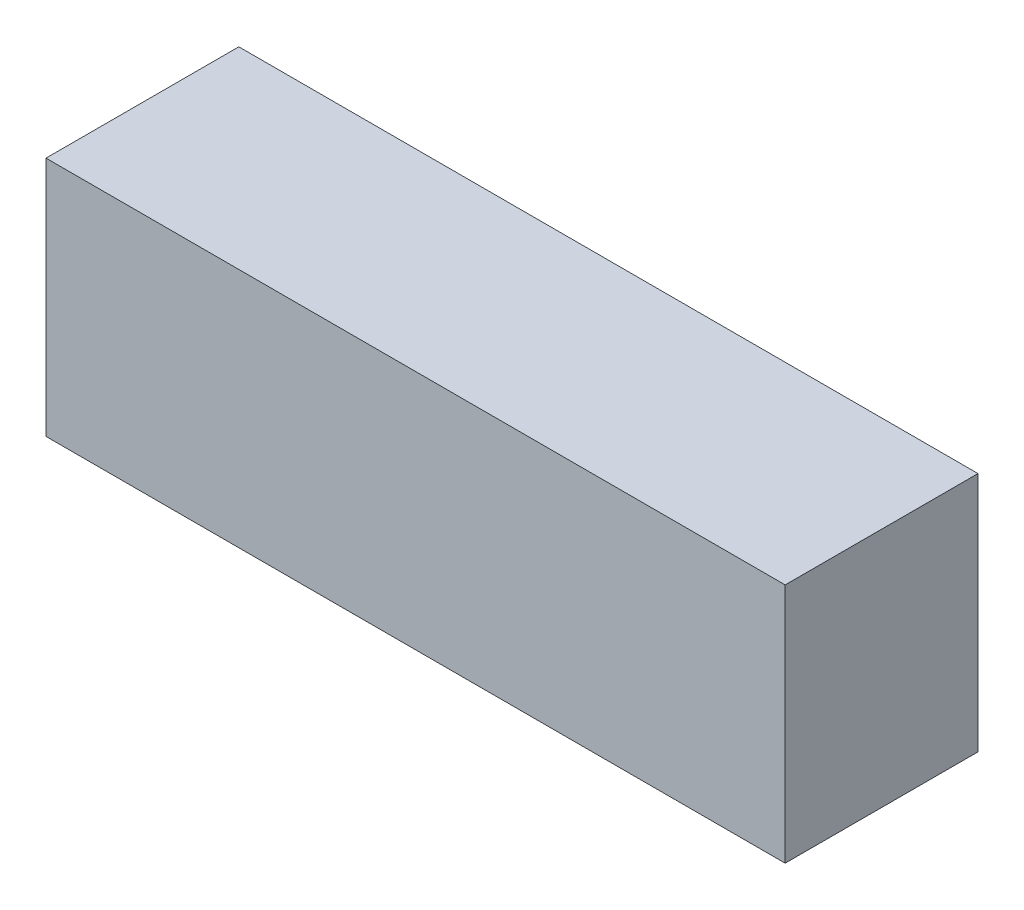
ISO-10303-21;
HEADER;
FILE_DESCRIPTION(('STEP AP214'),'2;1');
FILE_NAME('part.step','',(''),(''),'','','');
FILE_SCHEMA(('AUTOMOTIVE_DESIGN { 1 0 10303 214 1 1 1 1 }'));
ENDSEC;
DATA;
#1=APPLICATION_CONTEXT('core data for automotive mechanical design processes');
#2=APPLICATION_PROTOCOL_DEFINITION('international standard','automotive_design',2000,#1);
#3=PRODUCT_CONTEXT('',#1,'mechanical');
#4=PRODUCT('Part','Part','',(#3));
#5=PRODUCT_RELATED_PRODUCT_CATEGORY('part','',(#4));
#6=PRODUCT_DEFINITION_FORMATION('','',#4);
#7=PRODUCT_DEFINITION_CONTEXT('part definition',#1,'design');
#8=PRODUCT_DEFINITION('design','',#6,#7);
#9=PRODUCT_DEFINITION_SHAPE('','',#8);
#10=(LENGTH_UNIT() NAMED_UNIT(*) SI_UNIT(.MILLI.,.METRE.));
#11=(NAMED_UNIT(*) PLANE_ANGLE_UNIT() SI_UNIT($,.RADIAN.));
#12=(NAMED_UNIT(*) SI_UNIT($,.STERADIAN.) SOLID_ANGLE_UNIT());
#13=UNCERTAINTY_MEASURE_WITH_UNIT(LENGTH_MEASURE(1.E-05),#10,'distance_accuracy_value','');
#14=(GEOMETRIC_REPRESENTATION_CONTEXT(3) GLOBAL_UNCERTAINTY_ASSIGNED_CONTEXT((#13)) GLOBAL_UNIT_ASSIGNED_CONTEXT((#10,
#11,#12)) REPRESENTATION_CONTEXT('',''));
#15=CARTESIAN_POINT('',(0.,0.,0.));
#16=DIRECTION('',(0.,0.,1.));
#17=DIRECTION('',(1.,0.,0.));
#18=AXIS2_PLACEMENT_3D('',#15,#16,#17);
#19=CARTESIAN_POINT('',(115.,37.5,-30.));
#20=DIRECTION('',(-1.,0.,0.));
#21=DIRECTION('',(0.,0.,1.));
#22=AXIS2_PLACEMENT_3D('',#19,#20,#21);
#23=PLANE('',#22);
#24=DIRECTION('',(0.,0.,-1.));
#25=VECTOR('',#24,1.);
#26=CARTESIAN_POINT('',(115.,-37.5,-30.));
#27=LINE('',#26,#25);
#28=CARTESIAN_POINT('',(115.,-37.5,30.));
#29=VERTEX_POINT('',#28);
#30=CARTESIAN_POINT('',(115.,-37.5,-30.));
#31=VERTEX_POINT('',#30);
#32=EDGE_CURVE('E107',#29,#31,#27,.T.);
#33=ORIENTED_EDGE('',*,*,#32,.T.);
#34=DIRECTION('',(0.,-1.,0.));
#35=VECTOR('',#34,1.);
#36=CARTESIAN_POINT('',(115.,37.5,-30.));
#37=LINE('',#36,#35);
#38=CARTESIAN_POINT('',(115.,37.5,-30.));
#39=VERTEX_POINT('',#38);
#40=EDGE_CURVE('E11',#39,#31,#37,.T.);
#41=ORIENTED_EDGE('',*,*,#40,.F.);
#42=DIRECTION('',(0.,0.,-1.));
#43=VECTOR('',#42,1.);
#44=CARTESIAN_POINT('',(115.,37.5,-30.));
#45=LINE('',#44,#43);
#46=CARTESIAN_POINT('',(115.,37.5,30.));
#47=VERTEX_POINT('',#46);
#48=EDGE_CURVE('E91',#47,#39,#45,.T.);
#49=ORIENTED_EDGE('',*,*,#48,.F.);
#50=DIRECTION('',(0.,-1.,0.));
#51=VECTOR('',#50,1.);
#52=CARTESIAN_POINT('',(115.,37.5,30.));
#53=LINE('',#52,#51);
#54=EDGE_CURVE('E103',#47,#29,#53,.T.);
#55=ORIENTED_EDGE('',*,*,#54,.T.);
#56=EDGE_LOOP('',(#33,#41,#49,#55));
#57=FACE_BOUND('',#56,.T.);
#58=ADVANCED_FACE('F39',(#57),#23,.F.);
#59=CARTESIAN_POINT('',(-115.,37.5,-30.));
#60=DIRECTION('',(0.,0.,1.));
#61=DIRECTION('',(1.,0.,0.));
#62=AXIS2_PLACEMENT_3D('',#59,#60,#61);
#63=PLANE('',#62);
#64=DIRECTION('',(-1.,0.,0.));
#65=VECTOR('',#64,1.);
#66=CARTESIAN_POINT('',(-115.,-37.5,-30.));
#67=LINE('',#66,#65);
#68=CARTESIAN_POINT('',(-115.,-37.5,-30.));
#69=VERTEX_POINT('',#68);
#70=EDGE_CURVE('E96',#31,#69,#67,.T.);
#71=ORIENTED_EDGE('',*,*,#70,.T.);
#72=DIRECTION('',(0.,-1.,0.));
#73=VECTOR('',#72,1.);
#74=CARTESIAN_POINT('',(-115.,37.5,-30.));
#75=LINE('',#74,#73);
#76=CARTESIAN_POINT('',(-115.,37.5,-30.));
#77=VERTEX_POINT('',#76);
#78=EDGE_CURVE('E48',#77,#69,#75,.T.);
#79=ORIENTED_EDGE('',*,*,#78,.F.);
#80=DIRECTION('',(-1.,0.,0.));
#81=VECTOR('',#80,1.);
#82=CARTESIAN_POINT('',(-115.,37.5,-30.));
#83=LINE('',#82,#81);
#84=EDGE_CURVE('E86',#39,#77,#83,.T.);
#85=ORIENTED_EDGE('',*,*,#84,.F.);
#86=ORIENTED_EDGE('',*,*,#40,.T.);
#87=EDGE_LOOP('',(#71,#79,#85,#86));
#88=FACE_BOUND('',#87,.T.);
#89=ADVANCED_FACE('F95',(#88),#63,.F.);
#90=CARTESIAN_POINT('',(-115.,37.5,-30.));
#91=DIRECTION('',(1.,0.,0.));
#92=DIRECTION('',(0.,0.,-1.));
#93=AXIS2_PLACEMENT_3D('',#90,#91,#92);
#94=PLANE('',#93);
#95=DIRECTION('',(0.,0.,1.));
#96=VECTOR('',#95,1.);
#97=CARTESIAN_POINT('',(-115.,-37.5,-30.));
#98=LINE('',#97,#96);
#99=CARTESIAN_POINT('',(-115.,-37.5,30.));
#100=VERTEX_POINT('',#99);
#101=EDGE_CURVE('E73',#69,#100,#98,.T.);
#102=ORIENTED_EDGE('',*,*,#101,.T.);
#103=DIRECTION('',(0.,-1.,0.));
#104=VECTOR('',#103,1.);
#105=CARTESIAN_POINT('',(-115.,37.5,30.));
#106=LINE('',#105,#104);
#107=CARTESIAN_POINT('',(-115.,37.5,30.));
#108=VERTEX_POINT('',#107);
#109=EDGE_CURVE('E98',#108,#100,#106,.T.);
#110=ORIENTED_EDGE('',*,*,#109,.F.);
#111=DIRECTION('',(0.,0.,1.));
#112=VECTOR('',#111,1.);
#113=CARTESIAN_POINT('',(-115.,37.5,-30.));
#114=LINE('',#113,#112);
#115=EDGE_CURVE('E89',#77,#108,#114,.T.);
#116=ORIENTED_EDGE('',*,*,#115,.F.);
#117=ORIENTED_EDGE('',*,*,#78,.T.);
#118=EDGE_LOOP('',(#102,#110,#116,#117));
#119=FACE_BOUND('',#118,.T.);
#120=ADVANCED_FACE('F99',(#119),#94,.F.);
#121=CARTESIAN_POINT('',(-115.,37.5,30.));
#122=DIRECTION('',(0.,0.,-1.));
#123=DIRECTION('',(-1.,0.,0.));
#124=AXIS2_PLACEMENT_3D('',#121,#122,#123);
#125=PLANE('',#124);
#126=DIRECTION('',(1.,0.,0.));
#127=VECTOR('',#126,1.);
#128=CARTESIAN_POINT('',(-115.,-37.5,30.));
#129=LINE('',#128,#127);
#130=EDGE_CURVE('E79',#100,#29,#129,.T.);
#131=ORIENTED_EDGE('',*,*,#130,.T.);
#132=ORIENTED_EDGE('',*,*,#54,.F.);
#133=DIRECTION('',(1.,0.,0.));
#134=VECTOR('',#133,1.);
#135=CARTESIAN_POINT('',(-115.,37.5,30.));
#136=LINE('',#135,#134);
#137=EDGE_CURVE('E56',#108,#47,#136,.T.);
#138=ORIENTED_EDGE('',*,*,#137,.F.);
#139=ORIENTED_EDGE('',*,*,#109,.T.);
#140=EDGE_LOOP('',(#131,#132,#138,#139));
#141=FACE_BOUND('',#140,.T.);
#142=ADVANCED_FACE('F120',(#141),#125,.F.);
#143=CARTESIAN_POINT('',(0.,37.5,0.));
#144=DIRECTION('',(0.,1.,0.));
#145=DIRECTION('',(0.,0.,1.));
#146=AXIS2_PLACEMENT_3D('',#143,#144,#145);
#147=PLANE('',#146);
#148=ORIENTED_EDGE('',*,*,#48,.T.);
#149=ORIENTED_EDGE('',*,*,#84,.T.);
#150=ORIENTED_EDGE('',*,*,#115,.T.);
#151=ORIENTED_EDGE('',*,*,#137,.T.);
#152=EDGE_LOOP('',(#148,#149,#150,#151));
#153=FACE_BOUND('',#152,.T.);
#154=ADVANCED_FACE('F87',(#153),#147,.T.);
#155=CARTESIAN_POINT('',(0.,-37.5,0.));
#156=DIRECTION('',(0.,1.,0.));
#157=DIRECTION('',(0.,0.,1.));
#158=AXIS2_PLACEMENT_3D('',#155,#156,#157);
#159=PLANE('',#158);
#160=ORIENTED_EDGE('',*,*,#32,.F.);
#161=ORIENTED_EDGE('',*,*,#130,.F.);
#162=ORIENTED_EDGE('',*,*,#101,.F.);
#163=ORIENTED_EDGE('',*,*,#70,.F.);
#164=EDGE_LOOP('',(#160,#161,#162,#163));
#165=FACE_BOUND('',#164,.T.);
#166=ADVANCED_FACE('F123',(#165),#159,.F.);
#167=CLOSED_SHELL('',(#58,#89,#120,#142,#154,#166));
#168=MANIFOLD_SOLID_BREP('B2',#167);
#169=ADVANCED_BREP_SHAPE_REPRESENTATION('',(#18,#168),#14);
#170=SHAPE_DEFINITION_REPRESENTATION(#9,#169);
ENDSEC;
END-ISO-10303-21;
